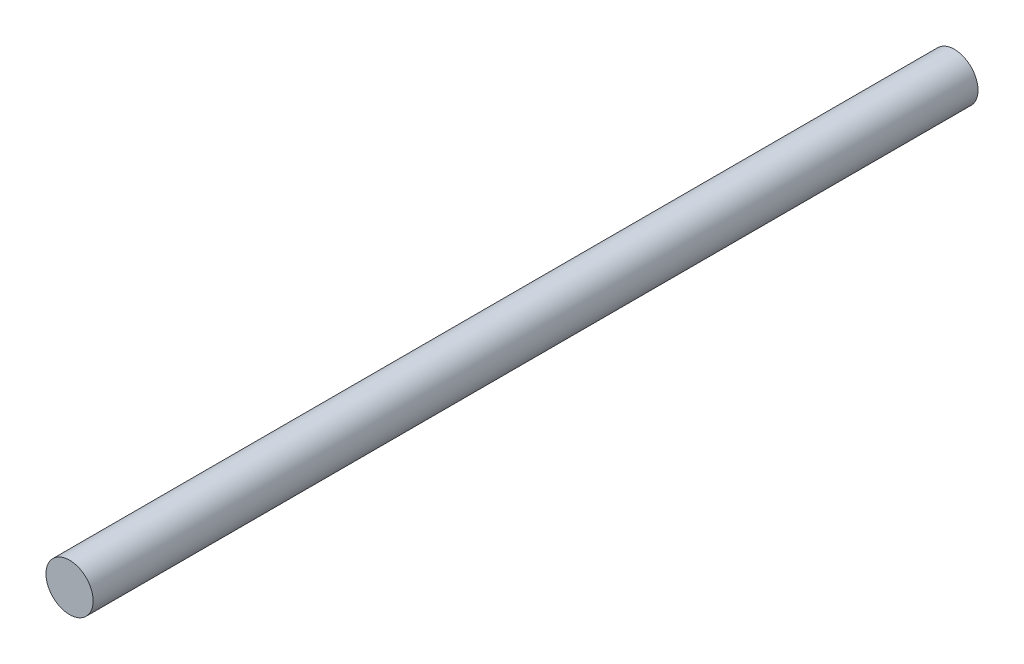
from build123d import *

# Parameters (mm, degrees)
SKETCH1_R           = 4
BOSS_EXTRUDE1_DEPTH = 150


with BuildPart() as part:
    # Sketch1 → Boss-Extrude1 (new body)
    with BuildSketch(Plane.XY):
        Circle(SKETCH1_R)
    extrude(amount=BOSS_EXTRUDE1_DEPTH)


solid = part.part
